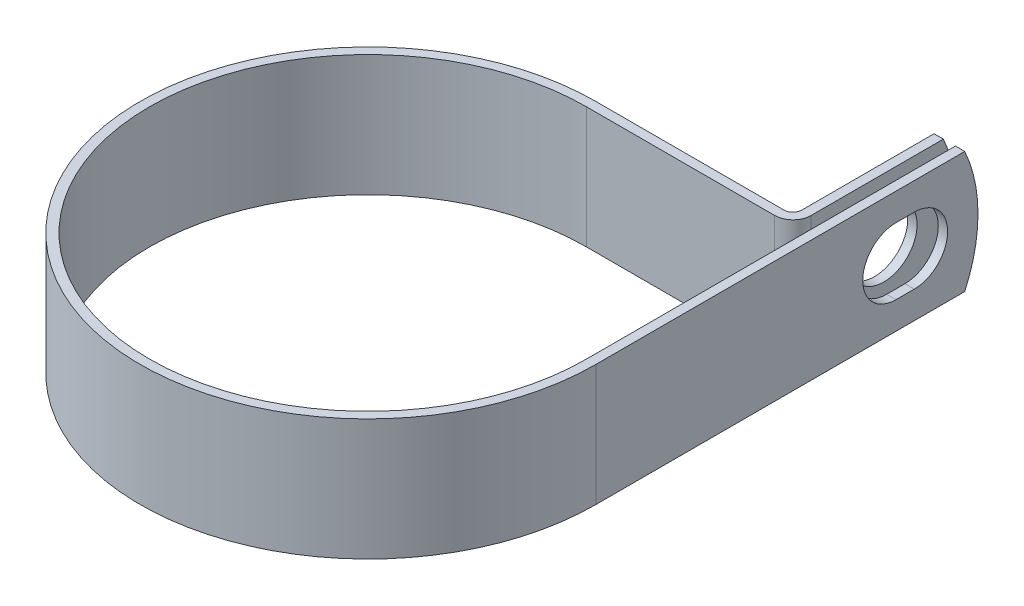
ISO-10303-21;
HEADER;
FILE_DESCRIPTION(('STEP AP214'),'2;1');
FILE_NAME('part.step','',(''),(''),'','','');
FILE_SCHEMA(('AUTOMOTIVE_DESIGN { 1 0 10303 214 1 1 1 1 }'));
ENDSEC;
DATA;
#1=APPLICATION_CONTEXT('core data for automotive mechanical design processes');
#2=APPLICATION_PROTOCOL_DEFINITION('international standard','automotive_design',2000,#1);
#3=PRODUCT_CONTEXT('',#1,'mechanical');
#4=PRODUCT('Part','Part','',(#3));
#5=PRODUCT_RELATED_PRODUCT_CATEGORY('part','',(#4));
#6=PRODUCT_DEFINITION_FORMATION('','',#4);
#7=PRODUCT_DEFINITION_CONTEXT('part definition',#1,'design');
#8=PRODUCT_DEFINITION('design','',#6,#7);
#9=PRODUCT_DEFINITION_SHAPE('','',#8);
#10=(LENGTH_UNIT() NAMED_UNIT(*) SI_UNIT(.MILLI.,.METRE.));
#11=(NAMED_UNIT(*) PLANE_ANGLE_UNIT() SI_UNIT($,.RADIAN.));
#12=(NAMED_UNIT(*) SI_UNIT($,.STERADIAN.) SOLID_ANGLE_UNIT());
#13=UNCERTAINTY_MEASURE_WITH_UNIT(LENGTH_MEASURE(1.E-05),#10,'distance_accuracy_value','');
#14=(GEOMETRIC_REPRESENTATION_CONTEXT(3) GLOBAL_UNCERTAINTY_ASSIGNED_CONTEXT((#13)) GLOBAL_UNIT_ASSIGNED_CONTEXT((#10,
#11,#12)) REPRESENTATION_CONTEXT('',''));
#15=CARTESIAN_POINT('',(0.,0.,0.));
#16=DIRECTION('',(0.,0.,1.));
#17=DIRECTION('',(1.,0.,0.));
#18=AXIS2_PLACEMENT_3D('',#15,#16,#17);
#19=CARTESIAN_POINT('',(28.575,7.9375,0.));
#20=DIRECTION('',(-1.,0.,0.));
#21=DIRECTION('',(0.,0.,1.));
#22=AXIS2_PLACEMENT_3D('',#19,#20,#21);
#23=PLANE('',#22);
#24=DIRECTION('',(0.,0.,-1.));
#25=VECTOR('',#24,1.);
#26=CARTESIAN_POINT('',(28.575,-4.3561,-39.2683999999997));
#27=LINE('',#26,#25);
#28=CARTESIAN_POINT('',(28.575,-4.3561,-39.2683999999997));
#29=VERTEX_POINT('',#28);
#30=CARTESIAN_POINT('',(28.575,-4.3561,-41.6560000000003));
#31=VERTEX_POINT('',#30);
#32=EDGE_CURVE('E236',#29,#31,#27,.T.);
#33=ORIENTED_EDGE('',*,*,#32,.T.);
#34=CARTESIAN_POINT('',(28.575,0.,-41.6559999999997));
#35=DIRECTION('',(-1.,0.,0.));
#36=DIRECTION('',(0.,0.,1.));
#37=AXIS2_PLACEMENT_3D('',#34,#35,#36);
#38=CIRCLE('',#37,4.3561);
#39=CARTESIAN_POINT('',(28.575,4.3561,-41.6560000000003));
#40=VERTEX_POINT('',#39);
#41=EDGE_CURVE('E257',#31,#40,#38,.F.);
#42=ORIENTED_EDGE('',*,*,#41,.T.);
#43=DIRECTION('',(0.,0.,1.));
#44=VECTOR('',#43,1.);
#45=CARTESIAN_POINT('',(28.575,4.3561,-39.2683999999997));
#46=LINE('',#45,#44);
#47=CARTESIAN_POINT('',(28.575,4.3561,-39.2683999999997));
#48=VERTEX_POINT('',#47);
#49=EDGE_CURVE('E253',#40,#48,#46,.T.);
#50=ORIENTED_EDGE('',*,*,#49,.T.);
#51=CARTESIAN_POINT('',(28.575,0.,-39.2683999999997));
#52=DIRECTION('',(-1.,0.,0.));
#53=DIRECTION('',(0.,0.,1.));
#54=AXIS2_PLACEMENT_3D('',#51,#52,#53);
#55=CIRCLE('',#54,4.3561);
#56=EDGE_CURVE('E248',#48,#29,#55,.F.);
#57=ORIENTED_EDGE('',*,*,#56,.T.);
#58=EDGE_LOOP('',(#33,#42,#50,#57));
#59=FACE_BOUND('',#58,.T.);
#60=CARTESIAN_POINT('',(28.575,0.,-30.9372));
#61=DIRECTION('',(-1.,0.,0.));
#62=DIRECTION('',(0.,0.,1.));
#63=AXIS2_PLACEMENT_3D('',#60,#61,#62);
#64=CIRCLE('',#63,19.05);
#65=CARTESIAN_POINT('',(28.575,7.9375,-48.2547804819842));
#66=VERTEX_POINT('',#65);
#67=CARTESIAN_POINT('',(28.575,-7.9375,-48.2547804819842));
#68=VERTEX_POINT('',#67);
#69=EDGE_CURVE('E75',#66,#68,#64,.T.);
#70=ORIENTED_EDGE('',*,*,#69,.T.);
#71=DIRECTION('',(0.,0.,-1.));
#72=VECTOR('',#71,1.);
#73=CARTESIAN_POINT('',(28.575,-7.9375,0.));
#74=LINE('',#73,#72);
#75=CARTESIAN_POINT('',(28.575,-7.9375,0.));
#76=VERTEX_POINT('',#75);
#77=EDGE_CURVE('E271',#76,#68,#74,.T.);
#78=ORIENTED_EDGE('',*,*,#77,.F.);
#79=DIRECTION('',(0.,-1.,0.));
#80=VECTOR('',#79,1.);
#81=CARTESIAN_POINT('',(28.575,7.9375,0.));
#82=LINE('',#81,#80);
#83=CARTESIAN_POINT('',(28.575,7.9375,0.));
#84=VERTEX_POINT('',#83);
#85=EDGE_CURVE('E218',#84,#76,#82,.T.);
#86=ORIENTED_EDGE('',*,*,#85,.F.);
#87=DIRECTION('',(0.,0.,-1.));
#88=VECTOR('',#87,1.);
#89=CARTESIAN_POINT('',(28.575,7.9375,-28.575));
#90=LINE('',#89,#88);
#91=EDGE_CURVE('E273',#84,#66,#90,.T.);
#92=ORIENTED_EDGE('',*,*,#91,.T.);
#93=EDGE_LOOP('',(#70,#78,#86,#92));
#94=FACE_BOUND('',#93,.T.);
#95=ADVANCED_FACE('F54',(#59,#94),#23,.T.);
#96=CARTESIAN_POINT('',(27.0002,7.9375,-49.9872));
#97=DIRECTION('',(1.,0.,0.));
#98=DIRECTION('',(0.,0.,-1.));
#99=AXIS2_PLACEMENT_3D('',#96,#97,#98);
#100=PLANE('',#99);
#101=CARTESIAN_POINT('',(27.0002,0.,-40.4622));
#102=DIRECTION('',(1.,0.,0.));
#103=DIRECTION('',(0.,0.,-1.));
#104=AXIS2_PLACEMENT_3D('',#101,#102,#103);
#105=CIRCLE('',#104,4.3561);
#106=CARTESIAN_POINT('',(27.0002,0.,-36.1061));
#107=VERTEX_POINT('',#106);
#108=EDGE_CURVE('E268',#107,#107,#105,.F.);
#109=ORIENTED_EDGE('',*,*,#108,.T.);
#110=EDGE_LOOP('',(#109));
#111=FACE_BOUND('',#110,.T.);
#112=DIRECTION('',(0.,0.,1.));
#113=VECTOR('',#112,1.);
#114=CARTESIAN_POINT('',(27.0002,-7.9375,-49.9872));
#115=LINE('',#114,#113);
#116=CARTESIAN_POINT('',(27.0002,-7.9375,-48.2547804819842));
#117=VERTEX_POINT('',#116);
#118=CARTESIAN_POINT('',(27.0002,-7.9375,-30.95244));
#119=VERTEX_POINT('',#118);
#120=EDGE_CURVE('E184',#117,#119,#115,.T.);
#121=ORIENTED_EDGE('',*,*,#120,.F.);
#122=CARTESIAN_POINT('',(27.0002,0.,-30.9372));
#123=DIRECTION('',(1.,0.,0.));
#124=DIRECTION('',(0.,0.,-1.));
#125=AXIS2_PLACEMENT_3D('',#122,#123,#124);
#126=CIRCLE('',#125,19.05);
#127=CARTESIAN_POINT('',(27.0002,7.9375,-48.2547804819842));
#128=VERTEX_POINT('',#127);
#129=EDGE_CURVE('E176',#117,#128,#126,.T.);
#130=ORIENTED_EDGE('',*,*,#129,.T.);
#131=DIRECTION('',(0.,0.,1.));
#132=VECTOR('',#131,1.);
#133=CARTESIAN_POINT('',(27.0002,7.9375,-49.9872));
#134=LINE('',#133,#132);
#135=CARTESIAN_POINT('',(27.0002,7.9375,-30.95244));
#136=VERTEX_POINT('',#135);
#137=EDGE_CURVE('E224',#128,#136,#134,.T.);
#138=ORIENTED_EDGE('',*,*,#137,.T.);
#139=DIRECTION('',(0.,-1.,0.));
#140=VECTOR('',#139,1.);
#141=CARTESIAN_POINT('',(27.0002,7.9375,-30.95244));
#142=LINE('',#141,#140);
#143=EDGE_CURVE('E211',#136,#119,#142,.T.);
#144=ORIENTED_EDGE('',*,*,#143,.T.);
#145=EDGE_LOOP('',(#121,#130,#138,#144));
#146=FACE_BOUND('',#145,.T.);
#147=ADVANCED_FACE('F226',(#111,#146),#100,.T.);
#148=CARTESIAN_POINT('',(25.781,7.9375,-49.9872));
#149=DIRECTION('',(1.,0.,0.));
#150=DIRECTION('',(0.,0.,-1.));
#151=AXIS2_PLACEMENT_3D('',#148,#149,#150);
#152=PLANE('',#151);
#153=CARTESIAN_POINT('',(25.781,0.,-40.4622));
#154=DIRECTION('',(-1.,0.,0.));
#155=DIRECTION('',(0.,0.,1.));
#156=AXIS2_PLACEMENT_3D('',#153,#154,#155);
#157=CIRCLE('',#156,4.3561);
#158=CARTESIAN_POINT('',(25.781,0.,-36.1061));
#159=VERTEX_POINT('',#158);
#160=EDGE_CURVE('E265',#159,#159,#157,.T.);
#161=ORIENTED_EDGE('',*,*,#160,.F.);
#162=EDGE_LOOP('',(#161));
#163=FACE_BOUND('',#162,.T.);
#164=CARTESIAN_POINT('',(25.781,0.,-30.9372));
#165=DIRECTION('',(-1.,0.,0.));
#166=DIRECTION('',(0.,0.,1.));
#167=AXIS2_PLACEMENT_3D('',#164,#165,#166);
#168=CIRCLE('',#167,19.05);
#169=CARTESIAN_POINT('',(25.781,7.9375,-48.2547804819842));
#170=VERTEX_POINT('',#169);
#171=CARTESIAN_POINT('',(25.781,-7.9375,-48.2547804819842));
#172=VERTEX_POINT('',#171);
#173=EDGE_CURVE('E67',#170,#172,#168,.T.);
#174=ORIENTED_EDGE('',*,*,#173,.T.);
#175=DIRECTION('',(0.,0.,1.));
#176=VECTOR('',#175,1.);
#177=CARTESIAN_POINT('',(25.781,-7.9375,-49.9872));
#178=LINE('',#177,#176);
#179=CARTESIAN_POINT('',(25.781,-7.9375,-30.95244));
#180=VERTEX_POINT('',#179);
#181=EDGE_CURVE('E167',#172,#180,#178,.T.);
#182=ORIENTED_EDGE('',*,*,#181,.T.);
#183=DIRECTION('',(0.,-1.,0.));
#184=VECTOR('',#183,1.);
#185=CARTESIAN_POINT('',(25.781,7.9375,-30.95244));
#186=LINE('',#185,#184);
#187=CARTESIAN_POINT('',(25.781,7.9375,-30.95244));
#188=VERTEX_POINT('',#187);
#189=EDGE_CURVE('E209',#188,#180,#186,.T.);
#190=ORIENTED_EDGE('',*,*,#189,.F.);
#191=DIRECTION('',(0.,0.,1.));
#192=VECTOR('',#191,1.);
#193=CARTESIAN_POINT('',(25.781,7.9375,-49.9872));
#194=LINE('',#193,#192);
#195=EDGE_CURVE('E169',#170,#188,#194,.T.);
#196=ORIENTED_EDGE('',*,*,#195,.F.);
#197=EDGE_LOOP('',(#174,#182,#190,#196));
#198=FACE_BOUND('',#197,.T.);
#199=ADVANCED_FACE('F164',(#163,#198),#152,.F.);
#200=CARTESIAN_POINT('',(29.7942,7.9375,0.));
#201=DIRECTION('',(-1.,0.,0.));
#202=DIRECTION('',(0.,0.,1.));
#203=AXIS2_PLACEMENT_3D('',#200,#201,#202);
#204=PLANE('',#203);
#205=CARTESIAN_POINT('',(29.7942,0.,-41.6559999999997));
#206=DIRECTION('',(1.,0.,0.));
#207=DIRECTION('',(0.,0.,-1.));
#208=AXIS2_PLACEMENT_3D('',#205,#206,#207);
#209=CIRCLE('',#208,4.3561);
#210=CARTESIAN_POINT('',(29.7942,-4.3561,-41.6560000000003));
#211=VERTEX_POINT('',#210);
#212=CARTESIAN_POINT('',(29.7942,4.3561,-41.6560000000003));
#213=VERTEX_POINT('',#212);
#214=EDGE_CURVE('E237',#211,#213,#209,.T.);
#215=ORIENTED_EDGE('',*,*,#214,.F.);
#216=DIRECTION('',(0.,0.,-1.));
#217=VECTOR('',#216,1.);
#218=CARTESIAN_POINT('',(29.7942,-4.3561,-39.2683999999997));
#219=LINE('',#218,#217);
#220=CARTESIAN_POINT('',(29.7942,-4.3561,-39.2683999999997));
#221=VERTEX_POINT('',#220);
#222=EDGE_CURVE('E240',#221,#211,#219,.T.);
#223=ORIENTED_EDGE('',*,*,#222,.F.);
#224=CARTESIAN_POINT('',(29.7942,0.,-39.2683999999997));
#225=DIRECTION('',(1.,0.,0.));
#226=DIRECTION('',(0.,0.,-1.));
#227=AXIS2_PLACEMENT_3D('',#224,#225,#226);
#228=CIRCLE('',#227,4.3561);
#229=CARTESIAN_POINT('',(29.7942,4.3561,-39.2683999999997));
#230=VERTEX_POINT('',#229);
#231=EDGE_CURVE('E230',#230,#221,#228,.T.);
#232=ORIENTED_EDGE('',*,*,#231,.F.);
#233=DIRECTION('',(0.,0.,1.));
#234=VECTOR('',#233,1.);
#235=CARTESIAN_POINT('',(29.7942,4.3561,-39.2683999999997));
#236=LINE('',#235,#234);
#237=EDGE_CURVE('E234',#213,#230,#236,.T.);
#238=ORIENTED_EDGE('',*,*,#237,.F.);
#239=EDGE_LOOP('',(#215,#223,#232,#238));
#240=FACE_BOUND('',#239,.T.);
#241=DIRECTION('',(0.,0.,-1.));
#242=VECTOR('',#241,1.);
#243=CARTESIAN_POINT('',(29.7942,-7.9375,0.));
#244=LINE('',#243,#242);
#245=CARTESIAN_POINT('',(29.7942,-7.9375,0.));
#246=VERTEX_POINT('',#245);
#247=CARTESIAN_POINT('',(29.7942,-7.9375,-48.2547804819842));
#248=VERTEX_POINT('',#247);
#249=EDGE_CURVE('E195',#246,#248,#244,.T.);
#250=ORIENTED_EDGE('',*,*,#249,.T.);
#251=CARTESIAN_POINT('',(29.7942,0.,-30.9372));
#252=DIRECTION('',(-1.,0.,0.));
#253=DIRECTION('',(0.,0.,1.));
#254=AXIS2_PLACEMENT_3D('',#251,#252,#253);
#255=CIRCLE('',#254,19.05);
#256=CARTESIAN_POINT('',(29.7942,7.9375,-48.2547804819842));
#257=VERTEX_POINT('',#256);
#258=EDGE_CURVE('E170',#257,#248,#255,.T.);
#259=ORIENTED_EDGE('',*,*,#258,.F.);
#260=DIRECTION('',(0.,0.,-1.));
#261=VECTOR('',#260,1.);
#262=CARTESIAN_POINT('',(29.7942,7.9375,-28.575));
#263=LINE('',#262,#261);
#264=CARTESIAN_POINT('',(29.7942,7.9375,0.));
#265=VERTEX_POINT('',#264);
#266=EDGE_CURVE('E198',#265,#257,#263,.T.);
#267=ORIENTED_EDGE('',*,*,#266,.F.);
#268=DIRECTION('',(0.,-1.,0.));
#269=VECTOR('',#268,1.);
#270=CARTESIAN_POINT('',(29.7942,7.9375,0.));
#271=LINE('',#270,#269);
#272=EDGE_CURVE('E199',#265,#246,#271,.T.);
#273=ORIENTED_EDGE('',*,*,#272,.T.);
#274=EDGE_LOOP('',(#250,#259,#267,#273));
#275=FACE_BOUND('',#274,.T.);
#276=ADVANCED_FACE('F321',(#240,#275),#204,.F.);
#277=CARTESIAN_POINT('',(0.,-7.9375,0.));
#278=DIRECTION('',(0.,1.,0.));
#279=DIRECTION('',(1.,0.,0.));
#280=AXIS2_PLACEMENT_3D('',#277,#278,#279);
#281=PLANE('',#280);
#282=DIRECTION('',(-1.,0.,0.));
#283=VECTOR('',#282,1.);
#284=CARTESIAN_POINT('',(29.7942,-7.9375,-48.2547804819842));
#285=LINE('',#284,#283);
#286=EDGE_CURVE('E171',#248,#68,#285,.T.);
#287=ORIENTED_EDGE('',*,*,#286,.F.);
#288=ORIENTED_EDGE('',*,*,#249,.F.);
#289=CARTESIAN_POINT('',(0.,-7.9375,0.));
#290=DIRECTION('',(0.,1.,0.));
#291=DIRECTION('',(1.,0.,0.));
#292=AXIS2_PLACEMENT_3D('',#289,#290,#291);
#293=CIRCLE('',#292,29.7942);
#294=CARTESIAN_POINT('',(0.,-7.9375,-29.7942));
#295=VERTEX_POINT('',#294);
#296=EDGE_CURVE('E193',#295,#246,#293,.T.);
#297=ORIENTED_EDGE('',*,*,#296,.F.);
#298=DIRECTION('',(1.,0.,0.));
#299=VECTOR('',#298,1.);
#300=CARTESIAN_POINT('',(0.,-7.9375,-29.7942));
#301=LINE('',#300,#299);
#302=CARTESIAN_POINT('',(24.62276,-7.9375,-29.7942));
#303=VERTEX_POINT('',#302);
#304=EDGE_CURVE('E186',#303,#295,#301,.F.);
#305=ORIENTED_EDGE('',*,*,#304,.F.);
#306=CARTESIAN_POINT('',(24.62276,-7.9375,-30.95244));
#307=DIRECTION('',(0.,1.,0.));
#308=DIRECTION('',(1.,0.,0.));
#309=AXIS2_PLACEMENT_3D('',#306,#307,#308);
#310=CIRCLE('',#309,1.15824);
#311=EDGE_CURVE('E183',#180,#303,#310,.F.);
#312=ORIENTED_EDGE('',*,*,#311,.F.);
#313=ORIENTED_EDGE('',*,*,#181,.F.);
#314=DIRECTION('',(-1.,0.,0.));
#315=VECTOR('',#314,1.);
#316=CARTESIAN_POINT('',(29.7942,-7.9375,-48.2547804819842));
#317=LINE('',#316,#315);
#318=EDGE_CURVE('E12',#117,#172,#317,.T.);
#319=ORIENTED_EDGE('',*,*,#318,.F.);
#320=ORIENTED_EDGE('',*,*,#120,.T.);
#321=CARTESIAN_POINT('',(24.62276,-7.9375,-30.95244));
#322=DIRECTION('',(0.,-1.,0.));
#323=DIRECTION('',(0.,0.,1.));
#324=AXIS2_PLACEMENT_3D('',#321,#322,#323);
#325=CIRCLE('',#324,2.37744);
#326=CARTESIAN_POINT('',(24.62276,-7.9375,-28.575));
#327=VERTEX_POINT('',#326);
#328=EDGE_CURVE('E188',#119,#327,#325,.T.);
#329=ORIENTED_EDGE('',*,*,#328,.T.);
#330=DIRECTION('',(-1.,0.,0.));
#331=VECTOR('',#330,1.);
#332=CARTESIAN_POINT('',(0.,-7.9375,-28.575));
#333=LINE('',#332,#331);
#334=CARTESIAN_POINT('',(0.,-7.9375,-28.575));
#335=VERTEX_POINT('',#334);
#336=EDGE_CURVE('E298',#327,#335,#333,.T.);
#337=ORIENTED_EDGE('',*,*,#336,.T.);
#338=CARTESIAN_POINT('',(0.,-7.9375,0.));
#339=DIRECTION('',(0.,1.,0.));
#340=DIRECTION('',(0.,0.,1.));
#341=AXIS2_PLACEMENT_3D('',#338,#339,#340);
#342=CIRCLE('',#341,28.575);
#343=EDGE_CURVE('E295',#335,#76,#342,.T.);
#344=ORIENTED_EDGE('',*,*,#343,.T.);
#345=ORIENTED_EDGE('',*,*,#77,.T.);
#346=EDGE_LOOP('',(#287,#288,#297,#305,#312,#313,#319,#320,#329,#337,#344,#345));
#347=FACE_BOUND('',#346,.T.);
#348=ADVANCED_FACE('F181',(#347),#281,.F.);
#349=CARTESIAN_POINT('',(0.,7.9375,0.));
#350=DIRECTION('',(0.,1.,0.));
#351=DIRECTION('',(1.,0.,0.));
#352=AXIS2_PLACEMENT_3D('',#349,#350,#351);
#353=PLANE('',#352);
#354=ORIENTED_EDGE('',*,*,#266,.T.);
#355=DIRECTION('',(-1.,0.,0.));
#356=VECTOR('',#355,1.);
#357=CARTESIAN_POINT('',(29.7942,7.9375,-48.2547804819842));
#358=LINE('',#357,#356);
#359=EDGE_CURVE('E228',#257,#66,#358,.T.);
#360=ORIENTED_EDGE('',*,*,#359,.T.);
#361=ORIENTED_EDGE('',*,*,#91,.F.);
#362=CARTESIAN_POINT('',(0.,7.9375,0.));
#363=DIRECTION('',(0.,1.,0.));
#364=DIRECTION('',(0.,0.,1.));
#365=AXIS2_PLACEMENT_3D('',#362,#363,#364);
#366=CIRCLE('',#365,28.575);
#367=CARTESIAN_POINT('',(0.,7.9375,-28.575));
#368=VERTEX_POINT('',#367);
#369=EDGE_CURVE('E276',#368,#84,#366,.T.);
#370=ORIENTED_EDGE('',*,*,#369,.F.);
#371=DIRECTION('',(-1.,0.,0.));
#372=VECTOR('',#371,1.);
#373=CARTESIAN_POINT('',(0.,7.9375,-28.575));
#374=LINE('',#373,#372);
#375=CARTESIAN_POINT('',(24.62276,7.9375,-28.575));
#376=VERTEX_POINT('',#375);
#377=EDGE_CURVE('E279',#376,#368,#374,.T.);
#378=ORIENTED_EDGE('',*,*,#377,.F.);
#379=CARTESIAN_POINT('',(24.62276,7.9375,-30.95244));
#380=DIRECTION('',(0.,-1.,0.));
#381=DIRECTION('',(0.,0.,1.));
#382=AXIS2_PLACEMENT_3D('',#379,#380,#381);
#383=CIRCLE('',#382,2.37744);
#384=EDGE_CURVE('E282',#136,#376,#383,.T.);
#385=ORIENTED_EDGE('',*,*,#384,.F.);
#386=ORIENTED_EDGE('',*,*,#137,.F.);
#387=DIRECTION('',(-1.,0.,0.));
#388=VECTOR('',#387,1.);
#389=CARTESIAN_POINT('',(29.7942,7.9375,-48.2547804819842));
#390=LINE('',#389,#388);
#391=EDGE_CURVE('E61',#128,#170,#390,.T.);
#392=ORIENTED_EDGE('',*,*,#391,.T.);
#393=ORIENTED_EDGE('',*,*,#195,.T.);
#394=CARTESIAN_POINT('',(24.62276,7.9375,-30.95244));
#395=DIRECTION('',(0.,1.,0.));
#396=DIRECTION('',(1.,0.,0.));
#397=AXIS2_PLACEMENT_3D('',#394,#395,#396);
#398=CIRCLE('',#397,1.15824);
#399=CARTESIAN_POINT('',(24.62276,7.9375,-29.7942));
#400=VERTEX_POINT('',#399);
#401=EDGE_CURVE('E287',#188,#400,#398,.F.);
#402=ORIENTED_EDGE('',*,*,#401,.T.);
#403=DIRECTION('',(1.,0.,0.));
#404=VECTOR('',#403,1.);
#405=CARTESIAN_POINT('',(0.,7.9375,-29.7942));
#406=LINE('',#405,#404);
#407=CARTESIAN_POINT('',(0.,7.9375,-29.7942));
#408=VERTEX_POINT('',#407);
#409=EDGE_CURVE('E289',#400,#408,#406,.F.);
#410=ORIENTED_EDGE('',*,*,#409,.T.);
#411=CARTESIAN_POINT('',(0.,7.9375,0.));
#412=DIRECTION('',(0.,1.,0.));
#413=DIRECTION('',(1.,0.,0.));
#414=AXIS2_PLACEMENT_3D('',#411,#412,#413);
#415=CIRCLE('',#414,29.7942);
#416=EDGE_CURVE('E203',#408,#265,#415,.T.);
#417=ORIENTED_EDGE('',*,*,#416,.T.);
#418=EDGE_LOOP('',(#354,#360,#361,#370,#378,#385,#386,#392,#393,#402,#410,#417));
#419=FACE_BOUND('',#418,.T.);
#420=ADVANCED_FACE('F222',(#419),#353,.T.);
#421=CARTESIAN_POINT('',(0.,7.9375,0.));
#422=DIRECTION('',(0.,-1.,0.));
#423=DIRECTION('',(0.,0.,-1.));
#424=AXIS2_PLACEMENT_3D('',#421,#422,#423);
#425=CYLINDRICAL_SURFACE('',#424,28.575);
#426=ORIENTED_EDGE('',*,*,#343,.F.);
#427=DIRECTION('',(0.,-1.,0.));
#428=VECTOR('',#427,1.);
#429=CARTESIAN_POINT('',(0.,7.9375,-28.575));
#430=LINE('',#429,#428);
#431=EDGE_CURVE('E216',#368,#335,#430,.T.);
#432=ORIENTED_EDGE('',*,*,#431,.F.);
#433=ORIENTED_EDGE('',*,*,#369,.T.);
#434=ORIENTED_EDGE('',*,*,#85,.T.);
#435=EDGE_LOOP('',(#426,#432,#433,#434));
#436=FACE_BOUND('',#435,.T.);
#437=ADVANCED_FACE('F311',(#436),#425,.F.);
#438=CARTESIAN_POINT('',(0.,7.9375,-28.575));
#439=DIRECTION('',(0.,0.,1.));
#440=DIRECTION('',(1.,0.,0.));
#441=AXIS2_PLACEMENT_3D('',#438,#439,#440);
#442=PLANE('',#441);
#443=ORIENTED_EDGE('',*,*,#336,.F.);
#444=DIRECTION('',(0.,-1.,0.));
#445=VECTOR('',#444,1.);
#446=CARTESIAN_POINT('',(24.62276,7.9375,-28.575));
#447=LINE('',#446,#445);
#448=EDGE_CURVE('E214',#376,#327,#447,.T.);
#449=ORIENTED_EDGE('',*,*,#448,.F.);
#450=ORIENTED_EDGE('',*,*,#377,.T.);
#451=ORIENTED_EDGE('',*,*,#431,.T.);
#452=EDGE_LOOP('',(#443,#449,#450,#451));
#453=FACE_BOUND('',#452,.T.);
#454=ADVANCED_FACE('F307',(#453),#442,.T.);
#455=CARTESIAN_POINT('',(24.62276,7.9375,-30.95244));
#456=DIRECTION('',(0.,-1.,0.));
#457=DIRECTION('',(0.,0.,-1.));
#458=AXIS2_PLACEMENT_3D('',#455,#456,#457);
#459=CYLINDRICAL_SURFACE('',#458,2.37744);
#460=ORIENTED_EDGE('',*,*,#328,.F.);
#461=ORIENTED_EDGE('',*,*,#143,.F.);
#462=ORIENTED_EDGE('',*,*,#384,.T.);
#463=ORIENTED_EDGE('',*,*,#448,.T.);
#464=EDGE_LOOP('',(#460,#461,#462,#463));
#465=FACE_BOUND('',#464,.T.);
#466=ADVANCED_FACE('F304',(#465),#459,.T.);
#467=CARTESIAN_POINT('',(24.62276,7.9375,-30.95244));
#468=DIRECTION('',(0.,-1.,0.));
#469=DIRECTION('',(0.,0.,-1.));
#470=AXIS2_PLACEMENT_3D('',#467,#468,#469);
#471=CYLINDRICAL_SURFACE('',#470,1.15824);
#472=ORIENTED_EDGE('',*,*,#311,.T.);
#473=DIRECTION('',(0.,-1.,0.));
#474=VECTOR('',#473,1.);
#475=CARTESIAN_POINT('',(24.62276,7.9375,-29.7942));
#476=LINE('',#475,#474);
#477=EDGE_CURVE('E206',#400,#303,#476,.T.);
#478=ORIENTED_EDGE('',*,*,#477,.F.);
#479=ORIENTED_EDGE('',*,*,#401,.F.);
#480=ORIENTED_EDGE('',*,*,#189,.T.);
#481=EDGE_LOOP('',(#472,#478,#479,#480));
#482=FACE_BOUND('',#481,.T.);
#483=ADVANCED_FACE('F334',(#482),#471,.F.);
#484=CARTESIAN_POINT('',(0.,7.9375,-29.7942));
#485=DIRECTION('',(0.,0.,1.));
#486=DIRECTION('',(1.,0.,0.));
#487=AXIS2_PLACEMENT_3D('',#484,#485,#486);
#488=PLANE('',#487);
#489=ORIENTED_EDGE('',*,*,#304,.T.);
#490=DIRECTION('',(0.,-1.,0.));
#491=VECTOR('',#490,1.);
#492=CARTESIAN_POINT('',(0.,7.9375,-29.7942));
#493=LINE('',#492,#491);
#494=EDGE_CURVE('E202',#408,#295,#493,.T.);
#495=ORIENTED_EDGE('',*,*,#494,.F.);
#496=ORIENTED_EDGE('',*,*,#409,.F.);
#497=ORIENTED_EDGE('',*,*,#477,.T.);
#498=EDGE_LOOP('',(#489,#495,#496,#497));
#499=FACE_BOUND('',#498,.T.);
#500=ADVANCED_FACE('F330',(#499),#488,.F.);
#501=CARTESIAN_POINT('',(0.,7.9375,0.));
#502=DIRECTION('',(0.,-1.,0.));
#503=DIRECTION('',(0.,0.,-1.));
#504=AXIS2_PLACEMENT_3D('',#501,#502,#503);
#505=CYLINDRICAL_SURFACE('',#504,29.7942);
#506=ORIENTED_EDGE('',*,*,#296,.T.);
#507=ORIENTED_EDGE('',*,*,#272,.F.);
#508=ORIENTED_EDGE('',*,*,#416,.F.);
#509=ORIENTED_EDGE('',*,*,#494,.T.);
#510=EDGE_LOOP('',(#506,#507,#508,#509));
#511=FACE_BOUND('',#510,.T.);
#512=ADVANCED_FACE('F327',(#511),#505,.T.);
#513=CARTESIAN_POINT('',(39.3211113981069,0.,-40.4622));
#514=DIRECTION('',(-1.,0.,0.));
#515=DIRECTION('',(0.,0.,1.));
#516=AXIS2_PLACEMENT_3D('',#513,#514,#515);
#517=CYLINDRICAL_SURFACE('',#516,4.3561);
#518=CARTESIAN_POINT('',(25.781,0.,-36.1061));
#519=CARTESIAN_POINT('',(25.7937,0.,-36.1061));
#520=CARTESIAN_POINT('',(25.8064,0.,-36.1061));
#521=CARTESIAN_POINT('',(25.8318,0.,-36.1061));
#522=CARTESIAN_POINT('',(25.8445,0.,-36.1061));
#523=CARTESIAN_POINT('',(25.8699,0.,-36.1061));
#524=CARTESIAN_POINT('',(25.8826,0.,-36.1061));
#525=CARTESIAN_POINT('',(25.908,0.,-36.1061));
#526=CARTESIAN_POINT('',(25.9207,0.,-36.1061));
#527=CARTESIAN_POINT('',(25.9461,0.,-36.1061));
#528=CARTESIAN_POINT('',(25.9588,0.,-36.1061));
#529=CARTESIAN_POINT('',(25.9842,0.,-36.1061));
#530=CARTESIAN_POINT('',(25.9969,0.,-36.1061));
#531=CARTESIAN_POINT('',(26.0223,0.,-36.1061));
#532=CARTESIAN_POINT('',(26.035,0.,-36.1061));
#533=CARTESIAN_POINT('',(26.0604,0.,-36.1061));
#534=CARTESIAN_POINT('',(26.0731,0.,-36.1061));
#535=CARTESIAN_POINT('',(26.0985,0.,-36.1061));
#536=CARTESIAN_POINT('',(26.1112,0.,-36.1061));
#537=CARTESIAN_POINT('',(26.1366,0.,-36.1061));
#538=CARTESIAN_POINT('',(26.1493,0.,-36.1061));
#539=CARTESIAN_POINT('',(26.1747,0.,-36.1061));
#540=CARTESIAN_POINT('',(26.1874,0.,-36.1061));
#541=CARTESIAN_POINT('',(26.2128,0.,-36.1061));
#542=CARTESIAN_POINT('',(26.2255,0.,-36.1061));
#543=CARTESIAN_POINT('',(26.2509,0.,-36.1061));
#544=CARTESIAN_POINT('',(26.2636,0.,-36.1061));
#545=CARTESIAN_POINT('',(26.289,0.,-36.1061));
#546=CARTESIAN_POINT('',(26.3017,0.,-36.1061));
#547=CARTESIAN_POINT('',(26.3271,0.,-36.1061));
#548=CARTESIAN_POINT('',(26.3398,0.,-36.1061));
#549=CARTESIAN_POINT('',(26.3652,0.,-36.1061));
#550=CARTESIAN_POINT('',(26.3779,0.,-36.1061));
#551=CARTESIAN_POINT('',(26.4033,0.,-36.1061));
#552=CARTESIAN_POINT('',(26.416,0.,-36.1061));
#553=CARTESIAN_POINT('',(26.4414,0.,-36.1061));
#554=CARTESIAN_POINT('',(26.4541,0.,-36.1061));
#555=CARTESIAN_POINT('',(26.4795,0.,-36.1061));
#556=CARTESIAN_POINT('',(26.4922,0.,-36.1061));
#557=CARTESIAN_POINT('',(26.5176,0.,-36.1061));
#558=CARTESIAN_POINT('',(26.5303,0.,-36.1061));
#559=CARTESIAN_POINT('',(26.5557,0.,-36.1061));
#560=CARTESIAN_POINT('',(26.5684,0.,-36.1061));
#561=CARTESIAN_POINT('',(26.5938,0.,-36.1061));
#562=CARTESIAN_POINT('',(26.6065,0.,-36.1061));
#563=CARTESIAN_POINT('',(26.6319,0.,-36.1061));
#564=CARTESIAN_POINT('',(26.6446,0.,-36.1061));
#565=CARTESIAN_POINT('',(26.67,0.,-36.1061));
#566=CARTESIAN_POINT('',(26.6827,0.,-36.1061));
#567=CARTESIAN_POINT('',(26.7081,0.,-36.1061));
#568=CARTESIAN_POINT('',(26.7208,0.,-36.1061));
#569=CARTESIAN_POINT('',(26.7462,0.,-36.1061));
#570=CARTESIAN_POINT('',(26.7589,0.,-36.1061));
#571=CARTESIAN_POINT('',(26.7843,0.,-36.1061));
#572=CARTESIAN_POINT('',(26.797,0.,-36.1061));
#573=CARTESIAN_POINT('',(26.8224,0.,-36.1061));
#574=CARTESIAN_POINT('',(26.8351,0.,-36.1061));
#575=CARTESIAN_POINT('',(26.8605,0.,-36.1061));
#576=CARTESIAN_POINT('',(26.8732,0.,-36.1061));
#577=CARTESIAN_POINT('',(26.8986,0.,-36.1061));
#578=CARTESIAN_POINT('',(26.9113,0.,-36.1061));
#579=CARTESIAN_POINT('',(26.9367,0.,-36.1061));
#580=CARTESIAN_POINT('',(26.9494,0.,-36.1061));
#581=CARTESIAN_POINT('',(26.9748,0.,-36.1061));
#582=CARTESIAN_POINT('',(26.9875,0.,-36.1061));
#583=CARTESIAN_POINT('',(27.0002,0.,-36.1061));
#584=B_SPLINE_CURVE_WITH_KNOTS('',3,(#518,#519,#520,#521,#522,#523,#524,#525,#526,#527,#528,
#529,#530,#531,#532,#533,#534,#535,#536,#537,#538,#539,#540,#541,#542,#543,#544,#545,#546,#547,
#548,#549,#550,#551,#552,#553,#554,#555,#556,#557,#558,#559,#560,#561,#562,#563,#564,#565,#566,
#567,#568,#569,#570,#571,#572,#573,#574,#575,#576,#577,#578,#579,#580,#581,#582,#583),
.UNSPECIFIED.,.F.,.F.,(4,2,2,2,2,2,2,2,2,2,2,2,2,2,2,2,2,2,2,2,2,2,2,2,2,2,2,2,2,2,2,2,4),(0.,
0.0380999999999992,0.076200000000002,0.114300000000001,0.152400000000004,0.190500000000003,
0.228600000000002,0.266700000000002,0.304800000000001,0.3429,0.380999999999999,
0.419099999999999,0.457199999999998,0.495300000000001,0.5334,0.571500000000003,
0.609600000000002,0.647700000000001,0.6858,0.7239,0.761999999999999,0.800099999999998,
0.838199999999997,0.8763,0.914399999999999,0.952499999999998,0.990600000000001,1.0287,1.0668,
1.1049,1.143,1.1811,1.2192),.UNSPECIFIED.);
#585=EDGE_CURVE('BSEAM379',#159,#107,#584,.T.);
#586=ORIENTED_EDGE('',*,*,#160,.T.);
#587=ORIENTED_EDGE('',*,*,#108,.F.);
#588=ORIENTED_EDGE('',*,*,#585,.T.);
#589=ORIENTED_EDGE('',*,*,#585,.F.);
#590=EDGE_LOOP('',(#586,#588,#587,#589));
#591=FACE_BOUND('',#590,.T.);
#592=ADVANCED_FACE('F379',(#591),#517,.F.);
#593=CARTESIAN_POINT('',(14.4644369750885,-4.3561,-39.2683999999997));
#594=DIRECTION('',(0.,-1.,0.));
#595=DIRECTION('',(0.,0.,-1.));
#596=AXIS2_PLACEMENT_3D('',#593,#594,#595);
#597=PLANE('',#596);
#598=DIRECTION('',(1.,0.,0.));
#599=VECTOR('',#598,1.);
#600=CARTESIAN_POINT('',(14.4644369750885,-4.3561,-39.2683999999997));
#601=LINE('',#600,#599);
#602=EDGE_CURVE('E251',#29,#221,#601,.T.);
#603=ORIENTED_EDGE('',*,*,#602,.T.);
#604=ORIENTED_EDGE('',*,*,#222,.T.);
#605=DIRECTION('',(1.,0.,0.));
#606=VECTOR('',#605,1.);
#607=CARTESIAN_POINT('',(14.4644369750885,-4.3561,-41.6560000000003));
#608=LINE('',#607,#606);
#609=EDGE_CURVE('E247',#31,#211,#608,.T.);
#610=ORIENTED_EDGE('',*,*,#609,.F.);
#611=ORIENTED_EDGE('',*,*,#32,.F.);
#612=EDGE_LOOP('',(#603,#604,#610,#611));
#613=FACE_BOUND('',#612,.T.);
#614=ADVANCED_FACE('F354',(#613),#597,.F.);
#615=CARTESIAN_POINT('',(14.4644369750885,0.,-41.6559999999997));
#616=DIRECTION('',(1.,0.,0.));
#617=DIRECTION('',(0.,0.,-1.));
#618=AXIS2_PLACEMENT_3D('',#615,#616,#617);
#619=CYLINDRICAL_SURFACE('',#618,4.3561);
#620=ORIENTED_EDGE('',*,*,#609,.T.);
#621=ORIENTED_EDGE('',*,*,#214,.T.);
#622=DIRECTION('',(1.,0.,0.));
#623=VECTOR('',#622,1.);
#624=CARTESIAN_POINT('',(14.4644369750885,4.3561,-41.6560000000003));
#625=LINE('',#624,#623);
#626=EDGE_CURVE('E256',#40,#213,#625,.T.);
#627=ORIENTED_EDGE('',*,*,#626,.F.);
#628=ORIENTED_EDGE('',*,*,#41,.F.);
#629=EDGE_LOOP('',(#620,#621,#627,#628));
#630=FACE_BOUND('',#629,.T.);
#631=ADVANCED_FACE('F358',(#630),#619,.F.);
#632=CARTESIAN_POINT('',(14.4644369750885,4.3561,-39.2683999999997));
#633=DIRECTION('',(0.,1.,0.));
#634=DIRECTION('',(0.,0.,1.));
#635=AXIS2_PLACEMENT_3D('',#632,#633,#634);
#636=PLANE('',#635);
#637=ORIENTED_EDGE('',*,*,#626,.T.);
#638=ORIENTED_EDGE('',*,*,#237,.T.);
#639=DIRECTION('',(1.,0.,0.));
#640=VECTOR('',#639,1.);
#641=CARTESIAN_POINT('',(14.4644369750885,4.3561,-39.2683999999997));
#642=LINE('',#641,#640);
#643=EDGE_CURVE('E252',#48,#230,#642,.T.);
#644=ORIENTED_EDGE('',*,*,#643,.F.);
#645=ORIENTED_EDGE('',*,*,#49,.F.);
#646=EDGE_LOOP('',(#637,#638,#644,#645));
#647=FACE_BOUND('',#646,.T.);
#648=ADVANCED_FACE('F362',(#647),#636,.F.);
#649=CARTESIAN_POINT('',(14.4644369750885,0.,-39.2683999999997));
#650=DIRECTION('',(1.,0.,0.));
#651=DIRECTION('',(0.,0.,-1.));
#652=AXIS2_PLACEMENT_3D('',#649,#650,#651);
#653=CYLINDRICAL_SURFACE('',#652,4.3561);
#654=ORIENTED_EDGE('',*,*,#643,.T.);
#655=ORIENTED_EDGE('',*,*,#231,.T.);
#656=ORIENTED_EDGE('',*,*,#602,.F.);
#657=ORIENTED_EDGE('',*,*,#56,.F.);
#658=EDGE_LOOP('',(#654,#655,#656,#657));
#659=FACE_BOUND('',#658,.T.);
#660=ADVANCED_FACE('F366',(#659),#653,.F.);
#661=CARTESIAN_POINT('',(29.7942,0.,-30.9372));
#662=DIRECTION('',(-1.,0.,0.));
#663=DIRECTION('',(0.,0.,1.));
#664=AXIS2_PLACEMENT_3D('',#661,#662,#663);
#665=CYLINDRICAL_SURFACE('',#664,19.05);
#666=ORIENTED_EDGE('',*,*,#129,.F.);
#667=ORIENTED_EDGE('',*,*,#318,.T.);
#668=ORIENTED_EDGE('',*,*,#173,.F.);
#669=ORIENTED_EDGE('',*,*,#391,.F.);
#670=EDGE_LOOP('',(#666,#667,#668,#669));
#671=FACE_BOUND('',#670,.T.);
#672=ADVANCED_FACE('F174',(#671),#665,.T.);
#673=ORIENTED_EDGE('',*,*,#359,.F.);
#674=ORIENTED_EDGE('',*,*,#258,.T.);
#675=ORIENTED_EDGE('',*,*,#286,.T.);
#676=ORIENTED_EDGE('',*,*,#69,.F.);
#677=EDGE_LOOP('',(#673,#674,#675,#676));
#678=FACE_BOUND('',#677,.T.);
#679=ADVANCED_FACE('F316',(#678),#665,.T.);
#680=CLOSED_SHELL('',(#95,#147,#199,#276,#348,#420,#437,#454,#466,#483,#500,#512,#592,#614,#631,
#648,#660,#672,#679));
#681=MANIFOLD_SOLID_BREP('B2',#680);
#682=ADVANCED_BREP_SHAPE_REPRESENTATION('',(#18,#681),#14);
#683=SHAPE_DEFINITION_REPRESENTATION(#9,#682);
ENDSEC;
END-ISO-10303-21;
